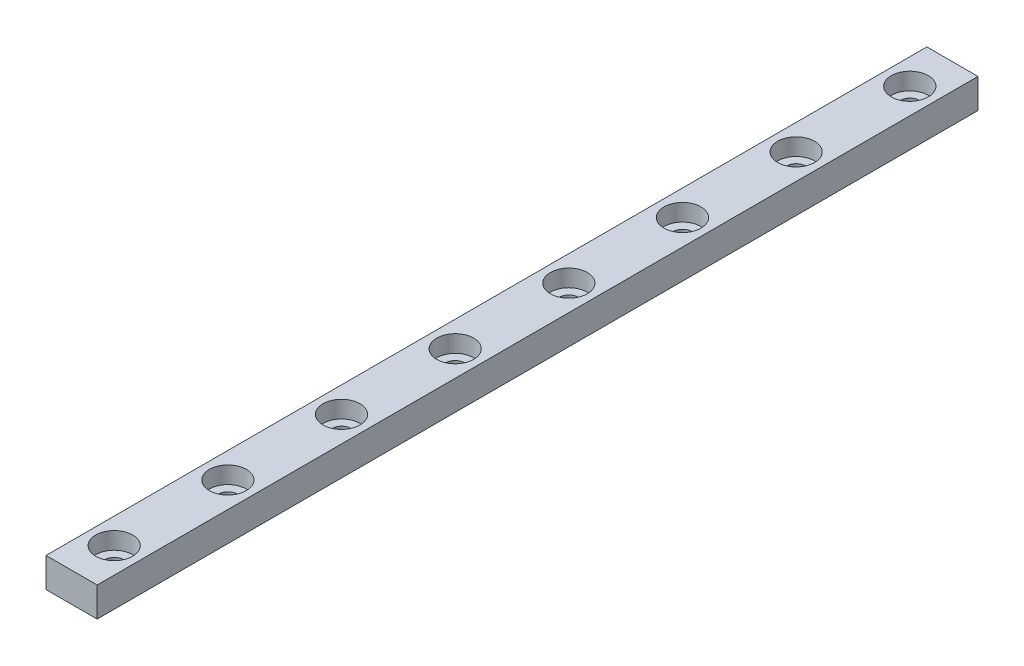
ISO-10303-21;
HEADER;
FILE_DESCRIPTION(('STEP AP214'),'2;1');
FILE_NAME('part.step','',(''),(''),'','','');
FILE_SCHEMA(('AUTOMOTIVE_DESIGN { 1 0 10303 214 1 1 1 1 }'));
ENDSEC;
DATA;
#1=APPLICATION_CONTEXT('core data for automotive mechanical design processes');
#2=APPLICATION_PROTOCOL_DEFINITION('international standard','automotive_design',2000,#1);
#3=PRODUCT_CONTEXT('',#1,'mechanical');
#4=PRODUCT('Part','Part','',(#3));
#5=PRODUCT_RELATED_PRODUCT_CATEGORY('part','',(#4));
#6=PRODUCT_DEFINITION_FORMATION('','',#4);
#7=PRODUCT_DEFINITION_CONTEXT('part definition',#1,'design');
#8=PRODUCT_DEFINITION('design','',#6,#7);
#9=PRODUCT_DEFINITION_SHAPE('','',#8);
#10=(LENGTH_UNIT() NAMED_UNIT(*) SI_UNIT(.MILLI.,.METRE.));
#11=(NAMED_UNIT(*) PLANE_ANGLE_UNIT() SI_UNIT($,.RADIAN.));
#12=(NAMED_UNIT(*) SI_UNIT($,.STERADIAN.) SOLID_ANGLE_UNIT());
#13=UNCERTAINTY_MEASURE_WITH_UNIT(LENGTH_MEASURE(1.E-05),#10,'distance_accuracy_value','');
#14=(GEOMETRIC_REPRESENTATION_CONTEXT(3) GLOBAL_UNCERTAINTY_ASSIGNED_CONTEXT((#13)) GLOBAL_UNIT_ASSIGNED_CONTEXT((#10,
#11,#12)) REPRESENTATION_CONTEXT('',''));
#15=CARTESIAN_POINT('',(0.,0.,0.));
#16=DIRECTION('',(0.,0.,1.));
#17=DIRECTION('',(1.,0.,0.));
#18=AXIS2_PLACEMENT_3D('',#15,#16,#17);
#19=CARTESIAN_POINT('',(4.5,0.,0.));
#20=DIRECTION('',(0.,0.,-1.));
#21=DIRECTION('',(-1.,0.,0.));
#22=AXIS2_PLACEMENT_3D('',#19,#20,#21);
#23=PLANE('',#22);
#24=DIRECTION('',(0.,-1.,0.));
#25=VECTOR('',#24,1.);
#26=CARTESIAN_POINT('',(-4.5,0.,0.));
#27=LINE('',#26,#25);
#28=CARTESIAN_POINT('',(-4.5,5.2,0.));
#29=VERTEX_POINT('',#28);
#30=CARTESIAN_POINT('',(-4.5,0.,0.));
#31=VERTEX_POINT('',#30);
#32=EDGE_CURVE('E95',#29,#31,#27,.T.);
#33=ORIENTED_EDGE('',*,*,#32,.T.);
#34=DIRECTION('',(-1.,0.,0.));
#35=VECTOR('',#34,1.);
#36=CARTESIAN_POINT('',(4.5,0.,0.));
#37=LINE('',#36,#35);
#38=CARTESIAN_POINT('',(4.5,0.,0.));
#39=VERTEX_POINT('',#38);
#40=EDGE_CURVE('E11',#39,#31,#37,.T.);
#41=ORIENTED_EDGE('',*,*,#40,.F.);
#42=DIRECTION('',(0.,-1.,0.));
#43=VECTOR('',#42,1.);
#44=CARTESIAN_POINT('',(4.5,0.,0.));
#45=LINE('',#44,#43);
#46=CARTESIAN_POINT('',(4.5,5.2,0.));
#47=VERTEX_POINT('',#46);
#48=EDGE_CURVE('E83',#47,#39,#45,.T.);
#49=ORIENTED_EDGE('',*,*,#48,.F.);
#50=DIRECTION('',(-1.,0.,0.));
#51=VECTOR('',#50,1.);
#52=CARTESIAN_POINT('',(4.5,5.2,0.));
#53=LINE('',#52,#51);
#54=EDGE_CURVE('E91',#47,#29,#53,.T.);
#55=ORIENTED_EDGE('',*,*,#54,.T.);
#56=EDGE_LOOP('',(#33,#41,#49,#55));
#57=FACE_BOUND('',#56,.T.);
#58=ADVANCED_FACE('F32',(#57),#23,.F.);
#59=CARTESIAN_POINT('',(4.5,0.,0.));
#60=DIRECTION('',(0.,1.,0.));
#61=DIRECTION('',(0.,0.,1.));
#62=AXIS2_PLACEMENT_3D('',#59,#60,#61);
#63=PLANE('',#62);
#64=CARTESIAN_POINT('',(0.,0.,-87.5));
#65=DIRECTION('',(0.,1.,0.));
#66=DIRECTION('',(0.,0.,1.));
#67=AXIS2_PLACEMENT_3D('',#64,#65,#66);
#68=CIRCLE('',#67,1.7);
#69=CARTESIAN_POINT('',(0.,0.,-85.8));
#70=VERTEX_POINT('',#69);
#71=EDGE_CURVE('E192',#70,#70,#68,.T.);
#72=ORIENTED_EDGE('',*,*,#71,.T.);
#73=EDGE_LOOP('',(#72));
#74=FACE_BOUND('',#73,.T.);
#75=CARTESIAN_POINT('',(0.,0.,-147.5));
#76=DIRECTION('',(0.,1.,0.));
#77=DIRECTION('',(0.,0.,1.));
#78=AXIS2_PLACEMENT_3D('',#75,#76,#77);
#79=CIRCLE('',#78,1.7);
#80=CARTESIAN_POINT('',(0.,0.,-145.8));
#81=VERTEX_POINT('',#80);
#82=EDGE_CURVE('E180',#81,#81,#79,.T.);
#83=ORIENTED_EDGE('',*,*,#82,.T.);
#84=EDGE_LOOP('',(#83));
#85=FACE_BOUND('',#84,.T.);
#86=CARTESIAN_POINT('',(0.,0.,-127.5));
#87=DIRECTION('',(0.,1.,0.));
#88=DIRECTION('',(0.,0.,1.));
#89=AXIS2_PLACEMENT_3D('',#86,#87,#88);
#90=CIRCLE('',#89,1.7);
#91=CARTESIAN_POINT('',(0.,0.,-125.8));
#92=VERTEX_POINT('',#91);
#93=EDGE_CURVE('E168',#92,#92,#90,.T.);
#94=ORIENTED_EDGE('',*,*,#93,.T.);
#95=EDGE_LOOP('',(#94));
#96=FACE_BOUND('',#95,.T.);
#97=CARTESIAN_POINT('',(0.,0.,-107.5));
#98=DIRECTION('',(0.,1.,0.));
#99=DIRECTION('',(0.,0.,1.));
#100=AXIS2_PLACEMENT_3D('',#97,#98,#99);
#101=CIRCLE('',#100,1.7);
#102=CARTESIAN_POINT('',(0.,0.,-105.8));
#103=VERTEX_POINT('',#102);
#104=EDGE_CURVE('E156',#103,#103,#101,.T.);
#105=ORIENTED_EDGE('',*,*,#104,.T.);
#106=EDGE_LOOP('',(#105));
#107=FACE_BOUND('',#106,.T.);
#108=CARTESIAN_POINT('',(0.,0.,-67.5));
#109=DIRECTION('',(0.,1.,0.));
#110=DIRECTION('',(0.,0.,1.));
#111=AXIS2_PLACEMENT_3D('',#108,#109,#110);
#112=CIRCLE('',#111,1.7);
#113=CARTESIAN_POINT('',(0.,0.,-65.8));
#114=VERTEX_POINT('',#113);
#115=EDGE_CURVE('E144',#114,#114,#112,.T.);
#116=ORIENTED_EDGE('',*,*,#115,.T.);
#117=EDGE_LOOP('',(#116));
#118=FACE_BOUND('',#117,.T.);
#119=CARTESIAN_POINT('',(0.,0.,-47.5));
#120=DIRECTION('',(0.,1.,0.));
#121=DIRECTION('',(0.,0.,1.));
#122=AXIS2_PLACEMENT_3D('',#119,#120,#121);
#123=CIRCLE('',#122,1.7);
#124=CARTESIAN_POINT('',(0.,0.,-45.8));
#125=VERTEX_POINT('',#124);
#126=EDGE_CURVE('E132',#125,#125,#123,.T.);
#127=ORIENTED_EDGE('',*,*,#126,.T.);
#128=EDGE_LOOP('',(#127));
#129=FACE_BOUND('',#128,.T.);
#130=CARTESIAN_POINT('',(0.,0.,-27.5000000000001));
#131=DIRECTION('',(0.,1.,0.));
#132=DIRECTION('',(0.,0.,1.));
#133=AXIS2_PLACEMENT_3D('',#130,#131,#132);
#134=CIRCLE('',#133,1.7);
#135=CARTESIAN_POINT('',(0.,0.,-25.8000000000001));
#136=VERTEX_POINT('',#135);
#137=EDGE_CURVE('E120',#136,#136,#134,.T.);
#138=ORIENTED_EDGE('',*,*,#137,.T.);
#139=EDGE_LOOP('',(#138));
#140=FACE_BOUND('',#139,.T.);
#141=CARTESIAN_POINT('',(0.,0.,-7.50000000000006));
#142=DIRECTION('',(0.,1.,0.));
#143=DIRECTION('',(0.,0.,1.));
#144=AXIS2_PLACEMENT_3D('',#141,#142,#143);
#145=CIRCLE('',#144,1.7);
#146=CARTESIAN_POINT('',(0.,0.,-5.80000000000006));
#147=VERTEX_POINT('',#146);
#148=EDGE_CURVE('E98',#147,#147,#145,.T.);
#149=ORIENTED_EDGE('',*,*,#148,.T.);
#150=EDGE_LOOP('',(#149));
#151=FACE_BOUND('',#150,.T.);
#152=DIRECTION('',(0.,0.,-1.));
#153=VECTOR('',#152,1.);
#154=CARTESIAN_POINT('',(-4.5,0.,0.));
#155=LINE('',#154,#153);
#156=CARTESIAN_POINT('',(-4.5,0.,-155.));
#157=VERTEX_POINT('',#156);
#158=EDGE_CURVE('E87',#31,#157,#155,.T.);
#159=ORIENTED_EDGE('',*,*,#158,.T.);
#160=DIRECTION('',(-1.,0.,0.));
#161=VECTOR('',#160,1.);
#162=CARTESIAN_POINT('',(4.5,0.,-155.));
#163=LINE('',#162,#161);
#164=CARTESIAN_POINT('',(4.5,0.,-155.));
#165=VERTEX_POINT('',#164);
#166=EDGE_CURVE('E40',#165,#157,#163,.T.);
#167=ORIENTED_EDGE('',*,*,#166,.F.);
#168=DIRECTION('',(0.,0.,-1.));
#169=VECTOR('',#168,1.);
#170=CARTESIAN_POINT('',(4.5,0.,0.));
#171=LINE('',#170,#169);
#172=EDGE_CURVE('E78',#39,#165,#171,.T.);
#173=ORIENTED_EDGE('',*,*,#172,.F.);
#174=ORIENTED_EDGE('',*,*,#40,.T.);
#175=EDGE_LOOP('',(#159,#167,#173,#174));
#176=FACE_BOUND('',#175,.T.);
#177=ADVANCED_FACE('F86',(#74,#85,#96,#107,#118,#129,#140,#151,#176),#63,.F.);
#178=CARTESIAN_POINT('',(4.5,0.,-155.));
#179=DIRECTION('',(0.,0.,1.));
#180=DIRECTION('',(1.,0.,0.));
#181=AXIS2_PLACEMENT_3D('',#178,#179,#180);
#182=PLANE('',#181);
#183=DIRECTION('',(0.,1.,0.));
#184=VECTOR('',#183,1.);
#185=CARTESIAN_POINT('',(-4.5,0.,-155.));
#186=LINE('',#185,#184);
#187=CARTESIAN_POINT('',(-4.5,5.2,-155.));
#188=VERTEX_POINT('',#187);
#189=EDGE_CURVE('E65',#157,#188,#186,.T.);
#190=ORIENTED_EDGE('',*,*,#189,.T.);
#191=DIRECTION('',(-1.,0.,0.));
#192=VECTOR('',#191,1.);
#193=CARTESIAN_POINT('',(4.5,5.2,-155.));
#194=LINE('',#193,#192);
#195=CARTESIAN_POINT('',(4.5,5.2,-155.));
#196=VERTEX_POINT('',#195);
#197=EDGE_CURVE('E88',#196,#188,#194,.T.);
#198=ORIENTED_EDGE('',*,*,#197,.F.);
#199=DIRECTION('',(0.,1.,0.));
#200=VECTOR('',#199,1.);
#201=CARTESIAN_POINT('',(4.5,0.,-155.));
#202=LINE('',#201,#200);
#203=EDGE_CURVE('E81',#165,#196,#202,.T.);
#204=ORIENTED_EDGE('',*,*,#203,.F.);
#205=ORIENTED_EDGE('',*,*,#166,.T.);
#206=EDGE_LOOP('',(#190,#198,#204,#205));
#207=FACE_BOUND('',#206,.T.);
#208=ADVANCED_FACE('F89',(#207),#182,.F.);
#209=CARTESIAN_POINT('',(4.5,5.2,0.));
#210=DIRECTION('',(0.,-1.,0.));
#211=DIRECTION('',(0.,0.,-1.));
#212=AXIS2_PLACEMENT_3D('',#209,#210,#211);
#213=PLANE('',#212);
#214=CARTESIAN_POINT('',(0.,5.2,-87.5));
#215=DIRECTION('',(0.,1.,0.));
#216=DIRECTION('',(0.,0.,1.));
#217=AXIS2_PLACEMENT_3D('',#214,#215,#216);
#218=CIRCLE('',#217,3.25);
#219=CARTESIAN_POINT('',(0.,5.2,-84.25));
#220=VERTEX_POINT('',#219);
#221=EDGE_CURVE('E201',#220,#220,#218,.T.);
#222=ORIENTED_EDGE('',*,*,#221,.F.);
#223=EDGE_LOOP('',(#222));
#224=FACE_BOUND('',#223,.T.);
#225=CARTESIAN_POINT('',(0.,5.2,-147.5));
#226=DIRECTION('',(0.,1.,0.));
#227=DIRECTION('',(0.,0.,1.));
#228=AXIS2_PLACEMENT_3D('',#225,#226,#227);
#229=CIRCLE('',#228,3.25);
#230=CARTESIAN_POINT('',(0.,5.2,-144.25));
#231=VERTEX_POINT('',#230);
#232=EDGE_CURVE('E189',#231,#231,#229,.T.);
#233=ORIENTED_EDGE('',*,*,#232,.F.);
#234=EDGE_LOOP('',(#233));
#235=FACE_BOUND('',#234,.T.);
#236=CARTESIAN_POINT('',(0.,5.2,-127.5));
#237=DIRECTION('',(0.,1.,0.));
#238=DIRECTION('',(0.,0.,1.));
#239=AXIS2_PLACEMENT_3D('',#236,#237,#238);
#240=CIRCLE('',#239,3.25);
#241=CARTESIAN_POINT('',(0.,5.2,-124.25));
#242=VERTEX_POINT('',#241);
#243=EDGE_CURVE('E177',#242,#242,#240,.T.);
#244=ORIENTED_EDGE('',*,*,#243,.F.);
#245=EDGE_LOOP('',(#244));
#246=FACE_BOUND('',#245,.T.);
#247=CARTESIAN_POINT('',(0.,5.2,-107.5));
#248=DIRECTION('',(0.,1.,0.));
#249=DIRECTION('',(0.,0.,1.));
#250=AXIS2_PLACEMENT_3D('',#247,#248,#249);
#251=CIRCLE('',#250,3.25);
#252=CARTESIAN_POINT('',(0.,5.2,-104.25));
#253=VERTEX_POINT('',#252);
#254=EDGE_CURVE('E165',#253,#253,#251,.T.);
#255=ORIENTED_EDGE('',*,*,#254,.F.);
#256=EDGE_LOOP('',(#255));
#257=FACE_BOUND('',#256,.T.);
#258=CARTESIAN_POINT('',(0.,5.2,-67.5));
#259=DIRECTION('',(0.,1.,0.));
#260=DIRECTION('',(0.,0.,1.));
#261=AXIS2_PLACEMENT_3D('',#258,#259,#260);
#262=CIRCLE('',#261,3.25);
#263=CARTESIAN_POINT('',(0.,5.2,-64.25));
#264=VERTEX_POINT('',#263);
#265=EDGE_CURVE('E153',#264,#264,#262,.T.);
#266=ORIENTED_EDGE('',*,*,#265,.F.);
#267=EDGE_LOOP('',(#266));
#268=FACE_BOUND('',#267,.T.);
#269=CARTESIAN_POINT('',(0.,5.2,-47.5));
#270=DIRECTION('',(0.,1.,0.));
#271=DIRECTION('',(0.,0.,1.));
#272=AXIS2_PLACEMENT_3D('',#269,#270,#271);
#273=CIRCLE('',#272,3.25);
#274=CARTESIAN_POINT('',(0.,5.2,-44.25));
#275=VERTEX_POINT('',#274);
#276=EDGE_CURVE('E141',#275,#275,#273,.T.);
#277=ORIENTED_EDGE('',*,*,#276,.F.);
#278=EDGE_LOOP('',(#277));
#279=FACE_BOUND('',#278,.T.);
#280=CARTESIAN_POINT('',(0.,5.2,-27.5000000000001));
#281=DIRECTION('',(0.,1.,0.));
#282=DIRECTION('',(0.,0.,1.));
#283=AXIS2_PLACEMENT_3D('',#280,#281,#282);
#284=CIRCLE('',#283,3.25);
#285=CARTESIAN_POINT('',(0.,5.2,-24.2500000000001));
#286=VERTEX_POINT('',#285);
#287=EDGE_CURVE('E129',#286,#286,#284,.T.);
#288=ORIENTED_EDGE('',*,*,#287,.F.);
#289=EDGE_LOOP('',(#288));
#290=FACE_BOUND('',#289,.T.);
#291=CARTESIAN_POINT('',(0.,5.2,-7.50000000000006));
#292=DIRECTION('',(0.,1.,0.));
#293=DIRECTION('',(0.,0.,1.));
#294=AXIS2_PLACEMENT_3D('',#291,#292,#293);
#295=CIRCLE('',#294,3.25);
#296=CARTESIAN_POINT('',(0.,5.2,-4.25000000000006));
#297=VERTEX_POINT('',#296);
#298=EDGE_CURVE('E117',#297,#297,#295,.T.);
#299=ORIENTED_EDGE('',*,*,#298,.F.);
#300=EDGE_LOOP('',(#299));
#301=FACE_BOUND('',#300,.T.);
#302=DIRECTION('',(0.,0.,1.));
#303=VECTOR('',#302,1.);
#304=CARTESIAN_POINT('',(-4.5,5.2,0.));
#305=LINE('',#304,#303);
#306=EDGE_CURVE('E71',#188,#29,#305,.T.);
#307=ORIENTED_EDGE('',*,*,#306,.T.);
#308=ORIENTED_EDGE('',*,*,#54,.F.);
#309=DIRECTION('',(0.,0.,1.));
#310=VECTOR('',#309,1.);
#311=CARTESIAN_POINT('',(4.5,5.2,0.));
#312=LINE('',#311,#310);
#313=EDGE_CURVE('E48',#196,#47,#312,.T.);
#314=ORIENTED_EDGE('',*,*,#313,.F.);
#315=ORIENTED_EDGE('',*,*,#197,.T.);
#316=EDGE_LOOP('',(#307,#308,#314,#315));
#317=FACE_BOUND('',#316,.T.);
#318=ADVANCED_FACE('F103',(#224,#235,#246,#257,#268,#279,#290,#301,#317),#213,.F.);
#319=CARTESIAN_POINT('',(4.5,0.,0.));
#320=DIRECTION('',(-1.,0.,0.));
#321=DIRECTION('',(0.,0.,1.));
#322=AXIS2_PLACEMENT_3D('',#319,#320,#321);
#323=PLANE('',#322);
#324=ORIENTED_EDGE('',*,*,#48,.T.);
#325=ORIENTED_EDGE('',*,*,#172,.T.);
#326=ORIENTED_EDGE('',*,*,#203,.T.);
#327=ORIENTED_EDGE('',*,*,#313,.T.);
#328=EDGE_LOOP('',(#324,#325,#326,#327));
#329=FACE_BOUND('',#328,.T.);
#330=ADVANCED_FACE('F79',(#329),#323,.F.);
#331=CARTESIAN_POINT('',(-4.5,0.,0.));
#332=DIRECTION('',(-1.,0.,0.));
#333=DIRECTION('',(0.,0.,1.));
#334=AXIS2_PLACEMENT_3D('',#331,#332,#333);
#335=PLANE('',#334);
#336=ORIENTED_EDGE('',*,*,#32,.F.);
#337=ORIENTED_EDGE('',*,*,#306,.F.);
#338=ORIENTED_EDGE('',*,*,#189,.F.);
#339=ORIENTED_EDGE('',*,*,#158,.F.);
#340=EDGE_LOOP('',(#336,#337,#338,#339));
#341=FACE_BOUND('',#340,.T.);
#342=ADVANCED_FACE('F106',(#341),#335,.T.);
#343=CARTESIAN_POINT('',(0.,5.2,-7.50000000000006));
#344=DIRECTION('',(0.,1.,0.));
#345=DIRECTION('',(0.,0.,1.));
#346=AXIS2_PLACEMENT_3D('',#343,#344,#345);
#347=CYLINDRICAL_SURFACE('',#346,1.7);
#348=ORIENTED_EDGE('',*,*,#148,.F.);
#349=EDGE_LOOP('',(#348));
#350=FACE_BOUND('',#349,.T.);
#351=CARTESIAN_POINT('',(0.,2.2,-7.50000000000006));
#352=DIRECTION('',(0.,1.,0.));
#353=DIRECTION('',(0.,0.,1.));
#354=AXIS2_PLACEMENT_3D('',#351,#352,#353);
#355=CIRCLE('',#354,1.7);
#356=CARTESIAN_POINT('',(0.,2.2,-5.80000000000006));
#357=VERTEX_POINT('',#356);
#358=EDGE_CURVE('E111',#357,#357,#355,.T.);
#359=ORIENTED_EDGE('',*,*,#358,.T.);
#360=EDGE_LOOP('',(#359));
#361=FACE_BOUND('',#360,.T.);
#362=ADVANCED_FACE('F237',(#350,#361),#347,.F.);
#363=CARTESIAN_POINT('',(1.70000000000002,2.2,-7.50000000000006));
#364=DIRECTION('',(0.,-1.,0.));
#365=DIRECTION('',(0.,0.,-1.));
#366=AXIS2_PLACEMENT_3D('',#363,#364,#365);
#367=PLANE('',#366);
#368=ORIENTED_EDGE('',*,*,#358,.F.);
#369=EDGE_LOOP('',(#368));
#370=FACE_BOUND('',#369,.T.);
#371=CARTESIAN_POINT('',(0.,2.2,-7.50000000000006));
#372=DIRECTION('',(0.,1.,0.));
#373=DIRECTION('',(0.,0.,1.));
#374=AXIS2_PLACEMENT_3D('',#371,#372,#373);
#375=CIRCLE('',#374,3.25);
#376=CARTESIAN_POINT('',(0.,2.2,-4.25000000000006));
#377=VERTEX_POINT('',#376);
#378=EDGE_CURVE('E114',#377,#377,#375,.T.);
#379=ORIENTED_EDGE('',*,*,#378,.T.);
#380=EDGE_LOOP('',(#379));
#381=FACE_BOUND('',#380,.T.);
#382=ADVANCED_FACE('F227',(#370,#381),#367,.F.);
#383=CARTESIAN_POINT('',(0.,5.2,-7.50000000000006));
#384=DIRECTION('',(0.,1.,0.));
#385=DIRECTION('',(0.,0.,1.));
#386=AXIS2_PLACEMENT_3D('',#383,#384,#385);
#387=CYLINDRICAL_SURFACE('',#386,3.25);
#388=ORIENTED_EDGE('',*,*,#378,.F.);
#389=EDGE_LOOP('',(#388));
#390=FACE_BOUND('',#389,.T.);
#391=ORIENTED_EDGE('',*,*,#298,.T.);
#392=EDGE_LOOP('',(#391));
#393=FACE_BOUND('',#392,.T.);
#394=ADVANCED_FACE('F224',(#390,#393),#387,.F.);
#395=CARTESIAN_POINT('',(0.,5.2,-27.5000000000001));
#396=DIRECTION('',(0.,1.,0.));
#397=DIRECTION('',(0.,0.,1.));
#398=AXIS2_PLACEMENT_3D('',#395,#396,#397);
#399=CYLINDRICAL_SURFACE('',#398,1.7);
#400=ORIENTED_EDGE('',*,*,#137,.F.);
#401=EDGE_LOOP('',(#400));
#402=FACE_BOUND('',#401,.T.);
#403=CARTESIAN_POINT('',(0.,2.2,-27.5000000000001));
#404=DIRECTION('',(0.,1.,0.));
#405=DIRECTION('',(0.,0.,1.));
#406=AXIS2_PLACEMENT_3D('',#403,#404,#405);
#407=CIRCLE('',#406,1.7);
#408=CARTESIAN_POINT('',(0.,2.2,-25.8000000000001));
#409=VERTEX_POINT('',#408);
#410=EDGE_CURVE('E123',#409,#409,#407,.T.);
#411=ORIENTED_EDGE('',*,*,#410,.T.);
#412=EDGE_LOOP('',(#411));
#413=FACE_BOUND('',#412,.T.);
#414=ADVANCED_FACE('F226',(#402,#413),#399,.F.);
#415=CARTESIAN_POINT('',(1.70000000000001,2.2,-27.5000000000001));
#416=DIRECTION('',(0.,-1.,0.));
#417=DIRECTION('',(0.,0.,-1.));
#418=AXIS2_PLACEMENT_3D('',#415,#416,#417);
#419=PLANE('',#418);
#420=ORIENTED_EDGE('',*,*,#410,.F.);
#421=EDGE_LOOP('',(#420));
#422=FACE_BOUND('',#421,.T.);
#423=CARTESIAN_POINT('',(0.,2.2,-27.5000000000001));
#424=DIRECTION('',(0.,1.,0.));
#425=DIRECTION('',(0.,0.,1.));
#426=AXIS2_PLACEMENT_3D('',#423,#424,#425);
#427=CIRCLE('',#426,3.25);
#428=CARTESIAN_POINT('',(0.,2.2,-24.2500000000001));
#429=VERTEX_POINT('',#428);
#430=EDGE_CURVE('E126',#429,#429,#427,.T.);
#431=ORIENTED_EDGE('',*,*,#430,.T.);
#432=EDGE_LOOP('',(#431));
#433=FACE_BOUND('',#432,.T.);
#434=ADVANCED_FACE('F234',(#422,#433),#419,.F.);
#435=CARTESIAN_POINT('',(0.,5.2,-27.5000000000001));
#436=DIRECTION('',(0.,1.,0.));
#437=DIRECTION('',(0.,0.,1.));
#438=AXIS2_PLACEMENT_3D('',#435,#436,#437);
#439=CYLINDRICAL_SURFACE('',#438,3.25);
#440=ORIENTED_EDGE('',*,*,#430,.F.);
#441=EDGE_LOOP('',(#440));
#442=FACE_BOUND('',#441,.T.);
#443=ORIENTED_EDGE('',*,*,#287,.T.);
#444=EDGE_LOOP('',(#443));
#445=FACE_BOUND('',#444,.T.);
#446=ADVANCED_FACE('F291',(#442,#445),#439,.F.);
#447=CARTESIAN_POINT('',(0.,5.2,-47.5));
#448=DIRECTION('',(0.,1.,0.));
#449=DIRECTION('',(0.,0.,1.));
#450=AXIS2_PLACEMENT_3D('',#447,#448,#449);
#451=CYLINDRICAL_SURFACE('',#450,1.7);
#452=ORIENTED_EDGE('',*,*,#126,.F.);
#453=EDGE_LOOP('',(#452));
#454=FACE_BOUND('',#453,.T.);
#455=CARTESIAN_POINT('',(0.,2.2,-47.5));
#456=DIRECTION('',(0.,1.,0.));
#457=DIRECTION('',(0.,0.,1.));
#458=AXIS2_PLACEMENT_3D('',#455,#456,#457);
#459=CIRCLE('',#458,1.7);
#460=CARTESIAN_POINT('',(0.,2.2,-45.8));
#461=VERTEX_POINT('',#460);
#462=EDGE_CURVE('E135',#461,#461,#459,.T.);
#463=ORIENTED_EDGE('',*,*,#462,.T.);
#464=EDGE_LOOP('',(#463));
#465=FACE_BOUND('',#464,.T.);
#466=ADVANCED_FACE('F301',(#454,#465),#451,.F.);
#467=CARTESIAN_POINT('',(1.70000000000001,2.2,-47.5));
#468=DIRECTION('',(0.,-1.,0.));
#469=DIRECTION('',(0.,0.,-1.));
#470=AXIS2_PLACEMENT_3D('',#467,#468,#469);
#471=PLANE('',#470);
#472=ORIENTED_EDGE('',*,*,#462,.F.);
#473=EDGE_LOOP('',(#472));
#474=FACE_BOUND('',#473,.T.);
#475=CARTESIAN_POINT('',(0.,2.2,-47.5));
#476=DIRECTION('',(0.,1.,0.));
#477=DIRECTION('',(0.,0.,1.));
#478=AXIS2_PLACEMENT_3D('',#475,#476,#477);
#479=CIRCLE('',#478,3.25);
#480=CARTESIAN_POINT('',(0.,2.2,-44.25));
#481=VERTEX_POINT('',#480);
#482=EDGE_CURVE('E138',#481,#481,#479,.T.);
#483=ORIENTED_EDGE('',*,*,#482,.T.);
#484=EDGE_LOOP('',(#483));
#485=FACE_BOUND('',#484,.T.);
#486=ADVANCED_FACE('F311',(#474,#485),#471,.F.);
#487=CARTESIAN_POINT('',(0.,5.2,-47.5));
#488=DIRECTION('',(0.,1.,0.));
#489=DIRECTION('',(0.,0.,1.));
#490=AXIS2_PLACEMENT_3D('',#487,#488,#489);
#491=CYLINDRICAL_SURFACE('',#490,3.25);
#492=ORIENTED_EDGE('',*,*,#482,.F.);
#493=EDGE_LOOP('',(#492));
#494=FACE_BOUND('',#493,.T.);
#495=ORIENTED_EDGE('',*,*,#276,.T.);
#496=EDGE_LOOP('',(#495));
#497=FACE_BOUND('',#496,.T.);
#498=ADVANCED_FACE('F321',(#494,#497),#491,.F.);
#499=CARTESIAN_POINT('',(0.,5.2,-67.5));
#500=DIRECTION('',(0.,1.,0.));
#501=DIRECTION('',(0.,0.,1.));
#502=AXIS2_PLACEMENT_3D('',#499,#500,#501);
#503=CYLINDRICAL_SURFACE('',#502,1.7);
#504=ORIENTED_EDGE('',*,*,#115,.F.);
#505=EDGE_LOOP('',(#504));
#506=FACE_BOUND('',#505,.T.);
#507=CARTESIAN_POINT('',(0.,2.2,-67.5));
#508=DIRECTION('',(0.,1.,0.));
#509=DIRECTION('',(0.,0.,1.));
#510=AXIS2_PLACEMENT_3D('',#507,#508,#509);
#511=CIRCLE('',#510,1.7);
#512=CARTESIAN_POINT('',(0.,2.2,-65.8));
#513=VERTEX_POINT('',#512);
#514=EDGE_CURVE('E147',#513,#513,#511,.T.);
#515=ORIENTED_EDGE('',*,*,#514,.T.);
#516=EDGE_LOOP('',(#515));
#517=FACE_BOUND('',#516,.T.);
#518=ADVANCED_FACE('F331',(#506,#517),#503,.F.);
#519=CARTESIAN_POINT('',(1.70000000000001,2.2,-67.5));
#520=DIRECTION('',(0.,-1.,0.));
#521=DIRECTION('',(0.,0.,-1.));
#522=AXIS2_PLACEMENT_3D('',#519,#520,#521);
#523=PLANE('',#522);
#524=ORIENTED_EDGE('',*,*,#514,.F.);
#525=EDGE_LOOP('',(#524));
#526=FACE_BOUND('',#525,.T.);
#527=CARTESIAN_POINT('',(0.,2.2,-67.5));
#528=DIRECTION('',(0.,1.,0.));
#529=DIRECTION('',(0.,0.,1.));
#530=AXIS2_PLACEMENT_3D('',#527,#528,#529);
#531=CIRCLE('',#530,3.25);
#532=CARTESIAN_POINT('',(0.,2.2,-64.25));
#533=VERTEX_POINT('',#532);
#534=EDGE_CURVE('E150',#533,#533,#531,.T.);
#535=ORIENTED_EDGE('',*,*,#534,.T.);
#536=EDGE_LOOP('',(#535));
#537=FACE_BOUND('',#536,.T.);
#538=ADVANCED_FACE('F341',(#526,#537),#523,.F.);
#539=CARTESIAN_POINT('',(0.,5.2,-67.5));
#540=DIRECTION('',(0.,1.,0.));
#541=DIRECTION('',(0.,0.,1.));
#542=AXIS2_PLACEMENT_3D('',#539,#540,#541);
#543=CYLINDRICAL_SURFACE('',#542,3.25);
#544=ORIENTED_EDGE('',*,*,#534,.F.);
#545=EDGE_LOOP('',(#544));
#546=FACE_BOUND('',#545,.T.);
#547=ORIENTED_EDGE('',*,*,#265,.T.);
#548=EDGE_LOOP('',(#547));
#549=FACE_BOUND('',#548,.T.);
#550=ADVANCED_FACE('F351',(#546,#549),#543,.F.);
#551=CARTESIAN_POINT('',(0.,5.2,-107.5));
#552=DIRECTION('',(0.,1.,0.));
#553=DIRECTION('',(0.,0.,1.));
#554=AXIS2_PLACEMENT_3D('',#551,#552,#553);
#555=CYLINDRICAL_SURFACE('',#554,1.7);
#556=ORIENTED_EDGE('',*,*,#104,.F.);
#557=EDGE_LOOP('',(#556));
#558=FACE_BOUND('',#557,.T.);
#559=CARTESIAN_POINT('',(0.,2.2,-107.5));
#560=DIRECTION('',(0.,1.,0.));
#561=DIRECTION('',(0.,0.,1.));
#562=AXIS2_PLACEMENT_3D('',#559,#560,#561);
#563=CIRCLE('',#562,1.7);
#564=CARTESIAN_POINT('',(0.,2.2,-105.8));
#565=VERTEX_POINT('',#564);
#566=EDGE_CURVE('E159',#565,#565,#563,.T.);
#567=ORIENTED_EDGE('',*,*,#566,.T.);
#568=EDGE_LOOP('',(#567));
#569=FACE_BOUND('',#568,.T.);
#570=ADVANCED_FACE('F361',(#558,#569),#555,.F.);
#571=CARTESIAN_POINT('',(1.7,2.2,-107.5));
#572=DIRECTION('',(0.,-1.,0.));
#573=DIRECTION('',(0.,0.,-1.));
#574=AXIS2_PLACEMENT_3D('',#571,#572,#573);
#575=PLANE('',#574);
#576=ORIENTED_EDGE('',*,*,#566,.F.);
#577=EDGE_LOOP('',(#576));
#578=FACE_BOUND('',#577,.T.);
#579=CARTESIAN_POINT('',(0.,2.2,-107.5));
#580=DIRECTION('',(0.,1.,0.));
#581=DIRECTION('',(0.,0.,1.));
#582=AXIS2_PLACEMENT_3D('',#579,#580,#581);
#583=CIRCLE('',#582,3.25);
#584=CARTESIAN_POINT('',(0.,2.2,-104.25));
#585=VERTEX_POINT('',#584);
#586=EDGE_CURVE('E162',#585,#585,#583,.T.);
#587=ORIENTED_EDGE('',*,*,#586,.T.);
#588=EDGE_LOOP('',(#587));
#589=FACE_BOUND('',#588,.T.);
#590=ADVANCED_FACE('F371',(#578,#589),#575,.F.);
#591=CARTESIAN_POINT('',(0.,5.2,-107.5));
#592=DIRECTION('',(0.,1.,0.));
#593=DIRECTION('',(0.,0.,1.));
#594=AXIS2_PLACEMENT_3D('',#591,#592,#593);
#595=CYLINDRICAL_SURFACE('',#594,3.25);
#596=ORIENTED_EDGE('',*,*,#586,.F.);
#597=EDGE_LOOP('',(#596));
#598=FACE_BOUND('',#597,.T.);
#599=ORIENTED_EDGE('',*,*,#254,.T.);
#600=EDGE_LOOP('',(#599));
#601=FACE_BOUND('',#600,.T.);
#602=ADVANCED_FACE('F381',(#598,#601),#595,.F.);
#603=CARTESIAN_POINT('',(0.,5.2,-127.5));
#604=DIRECTION('',(0.,1.,0.));
#605=DIRECTION('',(0.,0.,1.));
#606=AXIS2_PLACEMENT_3D('',#603,#604,#605);
#607=CYLINDRICAL_SURFACE('',#606,1.7);
#608=ORIENTED_EDGE('',*,*,#93,.F.);
#609=EDGE_LOOP('',(#608));
#610=FACE_BOUND('',#609,.T.);
#611=CARTESIAN_POINT('',(0.,2.2,-127.5));
#612=DIRECTION('',(0.,1.,0.));
#613=DIRECTION('',(0.,0.,1.));
#614=AXIS2_PLACEMENT_3D('',#611,#612,#613);
#615=CIRCLE('',#614,1.7);
#616=CARTESIAN_POINT('',(0.,2.2,-125.8));
#617=VERTEX_POINT('',#616);
#618=EDGE_CURVE('E171',#617,#617,#615,.T.);
#619=ORIENTED_EDGE('',*,*,#618,.T.);
#620=EDGE_LOOP('',(#619));
#621=FACE_BOUND('',#620,.T.);
#622=ADVANCED_FACE('F391',(#610,#621),#607,.F.);
#623=CARTESIAN_POINT('',(1.7,2.2,-127.5));
#624=DIRECTION('',(0.,-1.,0.));
#625=DIRECTION('',(0.,0.,-1.));
#626=AXIS2_PLACEMENT_3D('',#623,#624,#625);
#627=PLANE('',#626);
#628=ORIENTED_EDGE('',*,*,#618,.F.);
#629=EDGE_LOOP('',(#628));
#630=FACE_BOUND('',#629,.T.);
#631=CARTESIAN_POINT('',(0.,2.2,-127.5));
#632=DIRECTION('',(0.,1.,0.));
#633=DIRECTION('',(0.,0.,1.));
#634=AXIS2_PLACEMENT_3D('',#631,#632,#633);
#635=CIRCLE('',#634,3.25);
#636=CARTESIAN_POINT('',(0.,2.2,-124.25));
#637=VERTEX_POINT('',#636);
#638=EDGE_CURVE('E174',#637,#637,#635,.T.);
#639=ORIENTED_EDGE('',*,*,#638,.T.);
#640=EDGE_LOOP('',(#639));
#641=FACE_BOUND('',#640,.T.);
#642=ADVANCED_FACE('F401',(#630,#641),#627,.F.);
#643=CARTESIAN_POINT('',(0.,5.2,-127.5));
#644=DIRECTION('',(0.,1.,0.));
#645=DIRECTION('',(0.,0.,1.));
#646=AXIS2_PLACEMENT_3D('',#643,#644,#645);
#647=CYLINDRICAL_SURFACE('',#646,3.25);
#648=ORIENTED_EDGE('',*,*,#638,.F.);
#649=EDGE_LOOP('',(#648));
#650=FACE_BOUND('',#649,.T.);
#651=ORIENTED_EDGE('',*,*,#243,.T.);
#652=EDGE_LOOP('',(#651));
#653=FACE_BOUND('',#652,.T.);
#654=ADVANCED_FACE('F411',(#650,#653),#647,.F.);
#655=CARTESIAN_POINT('',(0.,5.2,-147.5));
#656=DIRECTION('',(0.,1.,0.));
#657=DIRECTION('',(0.,0.,1.));
#658=AXIS2_PLACEMENT_3D('',#655,#656,#657);
#659=CYLINDRICAL_SURFACE('',#658,1.7);
#660=ORIENTED_EDGE('',*,*,#82,.F.);
#661=EDGE_LOOP('',(#660));
#662=FACE_BOUND('',#661,.T.);
#663=CARTESIAN_POINT('',(0.,2.2,-147.5));
#664=DIRECTION('',(0.,1.,0.));
#665=DIRECTION('',(0.,0.,1.));
#666=AXIS2_PLACEMENT_3D('',#663,#664,#665);
#667=CIRCLE('',#666,1.7);
#668=CARTESIAN_POINT('',(0.,2.2,-145.8));
#669=VERTEX_POINT('',#668);
#670=EDGE_CURVE('E183',#669,#669,#667,.T.);
#671=ORIENTED_EDGE('',*,*,#670,.T.);
#672=EDGE_LOOP('',(#671));
#673=FACE_BOUND('',#672,.T.);
#674=ADVANCED_FACE('F421',(#662,#673),#659,.F.);
#675=CARTESIAN_POINT('',(1.7,2.2,-147.5));
#676=DIRECTION('',(0.,-1.,0.));
#677=DIRECTION('',(0.,0.,-1.));
#678=AXIS2_PLACEMENT_3D('',#675,#676,#677);
#679=PLANE('',#678);
#680=ORIENTED_EDGE('',*,*,#670,.F.);
#681=EDGE_LOOP('',(#680));
#682=FACE_BOUND('',#681,.T.);
#683=CARTESIAN_POINT('',(0.,2.2,-147.5));
#684=DIRECTION('',(0.,1.,0.));
#685=DIRECTION('',(0.,0.,1.));
#686=AXIS2_PLACEMENT_3D('',#683,#684,#685);
#687=CIRCLE('',#686,3.25);
#688=CARTESIAN_POINT('',(0.,2.2,-144.25));
#689=VERTEX_POINT('',#688);
#690=EDGE_CURVE('E186',#689,#689,#687,.T.);
#691=ORIENTED_EDGE('',*,*,#690,.T.);
#692=EDGE_LOOP('',(#691));
#693=FACE_BOUND('',#692,.T.);
#694=ADVANCED_FACE('F431',(#682,#693),#679,.F.);
#695=CARTESIAN_POINT('',(0.,5.2,-147.5));
#696=DIRECTION('',(0.,1.,0.));
#697=DIRECTION('',(0.,0.,1.));
#698=AXIS2_PLACEMENT_3D('',#695,#696,#697);
#699=CYLINDRICAL_SURFACE('',#698,3.25);
#700=ORIENTED_EDGE('',*,*,#690,.F.);
#701=EDGE_LOOP('',(#700));
#702=FACE_BOUND('',#701,.T.);
#703=ORIENTED_EDGE('',*,*,#232,.T.);
#704=EDGE_LOOP('',(#703));
#705=FACE_BOUND('',#704,.T.);
#706=ADVANCED_FACE('F441',(#702,#705),#699,.F.);
#707=CARTESIAN_POINT('',(0.,5.2,-87.5));
#708=DIRECTION('',(0.,1.,0.));
#709=DIRECTION('',(0.,0.,1.));
#710=AXIS2_PLACEMENT_3D('',#707,#708,#709);
#711=CYLINDRICAL_SURFACE('',#710,1.7);
#712=ORIENTED_EDGE('',*,*,#71,.F.);
#713=EDGE_LOOP('',(#712));
#714=FACE_BOUND('',#713,.T.);
#715=CARTESIAN_POINT('',(0.,2.2,-87.5));
#716=DIRECTION('',(0.,1.,0.));
#717=DIRECTION('',(0.,0.,1.));
#718=AXIS2_PLACEMENT_3D('',#715,#716,#717);
#719=CIRCLE('',#718,1.7);
#720=CARTESIAN_POINT('',(0.,2.2,-85.8));
#721=VERTEX_POINT('',#720);
#722=EDGE_CURVE('E195',#721,#721,#719,.T.);
#723=ORIENTED_EDGE('',*,*,#722,.T.);
#724=EDGE_LOOP('',(#723));
#725=FACE_BOUND('',#724,.T.);
#726=ADVANCED_FACE('F451',(#714,#725),#711,.F.);
#727=CARTESIAN_POINT('',(1.70000000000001,2.2,-87.5));
#728=DIRECTION('',(0.,-1.,0.));
#729=DIRECTION('',(0.,0.,-1.));
#730=AXIS2_PLACEMENT_3D('',#727,#728,#729);
#731=PLANE('',#730);
#732=ORIENTED_EDGE('',*,*,#722,.F.);
#733=EDGE_LOOP('',(#732));
#734=FACE_BOUND('',#733,.T.);
#735=CARTESIAN_POINT('',(0.,2.2,-87.5));
#736=DIRECTION('',(0.,1.,0.));
#737=DIRECTION('',(0.,0.,1.));
#738=AXIS2_PLACEMENT_3D('',#735,#736,#737);
#739=CIRCLE('',#738,3.25);
#740=CARTESIAN_POINT('',(0.,2.2,-84.25));
#741=VERTEX_POINT('',#740);
#742=EDGE_CURVE('E198',#741,#741,#739,.T.);
#743=ORIENTED_EDGE('',*,*,#742,.T.);
#744=EDGE_LOOP('',(#743));
#745=FACE_BOUND('',#744,.T.);
#746=ADVANCED_FACE('F461',(#734,#745),#731,.F.);
#747=CARTESIAN_POINT('',(0.,5.2,-87.5));
#748=DIRECTION('',(0.,1.,0.));
#749=DIRECTION('',(0.,0.,1.));
#750=AXIS2_PLACEMENT_3D('',#747,#748,#749);
#751=CYLINDRICAL_SURFACE('',#750,3.25);
#752=ORIENTED_EDGE('',*,*,#742,.F.);
#753=EDGE_LOOP('',(#752));
#754=FACE_BOUND('',#753,.T.);
#755=ORIENTED_EDGE('',*,*,#221,.T.);
#756=EDGE_LOOP('',(#755));
#757=FACE_BOUND('',#756,.T.);
#758=ADVANCED_FACE('F205',(#754,#757),#751,.F.);
#759=CLOSED_SHELL('',(#58,#177,#208,#318,#330,#342,#362,#382,#394,#414,#434,#446,#466,#486,#498,
#518,#538,#550,#570,#590,#602,#622,#642,#654,#674,#694,#706,#726,#746,#758));
#760=MANIFOLD_SOLID_BREP('B2',#759);
#761=ADVANCED_BREP_SHAPE_REPRESENTATION('',(#18,#760),#14);
#762=SHAPE_DEFINITION_REPRESENTATION(#9,#761);
ENDSEC;
END-ISO-10303-21;
